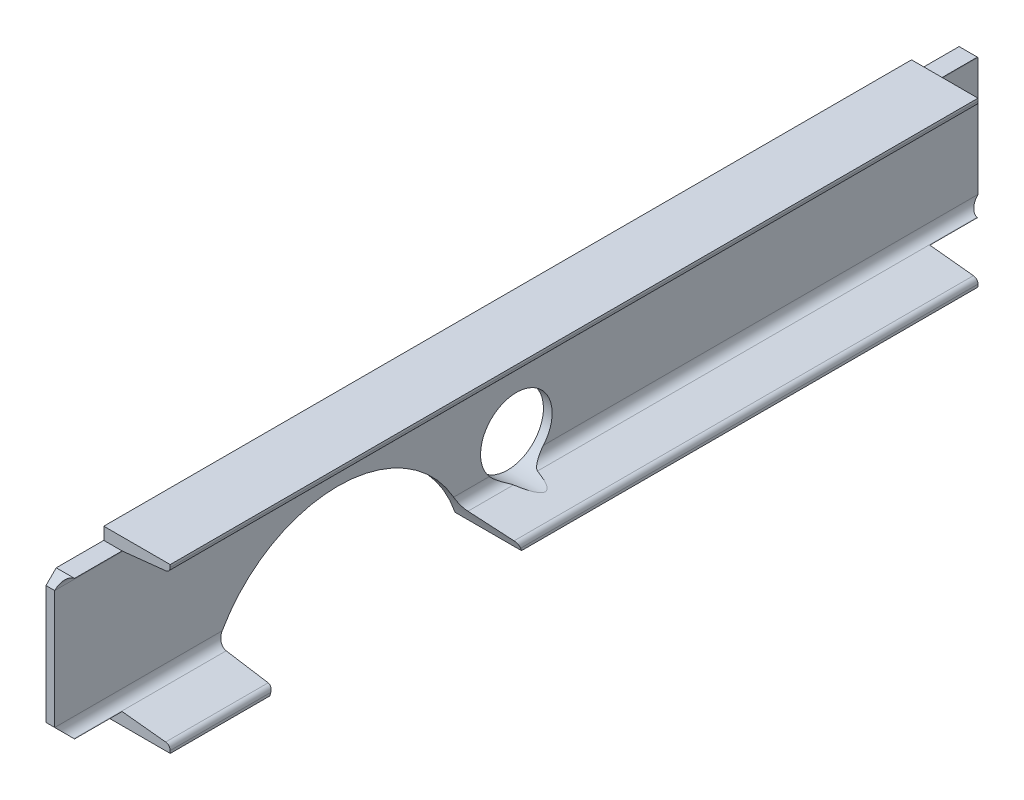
from build123d import *

# Parameters (mm, degrees)
EXTRUDE_1_DEPTH     = 451.5
SKETCH_2_W          = 65
SKETCH_2_H          = 12
CUT_EXTRUDE_1_DEPTH = 56.5
CUT_EXTRUDE_2_DEPTH = 464.116885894
SKETCH_4_R          = 35
CUT_EXTRUDE_3_DEPTH = 464.116886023
CHAMFER_1_SIZE      = 10


with BuildPart() as part:
    # Sketch 1 → Extrude 1 (new, symmetric)
    with BuildSketch(Plane.XY):
        with BuildLine():
            Line((65, 80), (0, 80))
            Line((0, 80), (0, -80))
            Line((0, -80), (65, -80))
            Line((65, -80), (65, -77.497140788))
            ThreePointArc((65, -77.497140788), (63.717527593, -74.153491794), (60.528004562, -72.52509783))
            Line((60.528004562, -72.52509783), (17.443990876, -67.949804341))
            ThreePointArc((17.443990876, -67.949804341), (11.064944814, -64.693016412), (8.5, -58.005718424))
            Line((8.5, -58.005718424), (8.5, 58.005718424))
            ThreePointArc((8.5, 58.005718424), (11.064944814, 64.693016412), (17.443990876, 67.949804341))
            Line((17.443990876, 67.949804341), (60.528004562, 72.52509783))
            ThreePointArc((60.528004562, 72.52509783), (63.717527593, 74.153491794), (65, 77.497140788))
            Line((65, 77.497140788), (65, 80))
        make_face()
    extrude(amount=EXTRUDE_1_DEPTH, both=True)

    # Sketch 2 → Cut-Extrude 1 (cut)
    with BuildSketch(Plane.XY.offset(451.5)):
        with Locations((32.5, 74)):
            Rectangle(SKETCH_2_W, SKETCH_2_H)
        with Locations((32.5, -74)):
            Rectangle(SKETCH_2_W, SKETCH_2_H)
    cut_extrude_1 = extrude(amount=-CUT_EXTRUDE_1_DEPTH, mode=Mode.SUBTRACT)

    # Mirror 1: Cut-Extrude 1 across plane
    add(cut_extrude_1.mirror(Plane.XY), mode=Mode.SUBTRACT)

    # Sketch 3 → Cut-Extrude 2 (cut, through all)
    with BuildSketch(Plane.ZY):
        with BuildLine():
            Line((51.471548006, -80), (297.528451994, -80))
            ThreePointArc((297.528451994, -80), (174.5, 8), (51.471548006, -80))
        make_face()
    extrude(amount=-CUT_EXTRUDE_2_DEPTH, mode=Mode.SUBTRACT)

    # Sketch 4 → Cut-Extrude 3 (cut, through all)
    with BuildSketch(Plane.ZY):
        with Locations(Location((0, -35, 0), (0, 0, 270))):
            Circle(SKETCH_4_R)
    extrude(amount=-CUT_EXTRUDE_3_DEPTH, mode=Mode.SUBTRACT)

    # Chamfer 1
    chamfer_1_edges = [part.edges().sort_by_distance(p)[0] for p in [
        (8.958333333, -68, -451.5),
        (8.958333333, 68, -451.5),
        (8.958333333, -68, 451.5),
        (8.958333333, 68, 451.5),
    ]]
    chamfer(chamfer_1_edges, length=CHAMFER_1_SIZE)


solid = part.part
